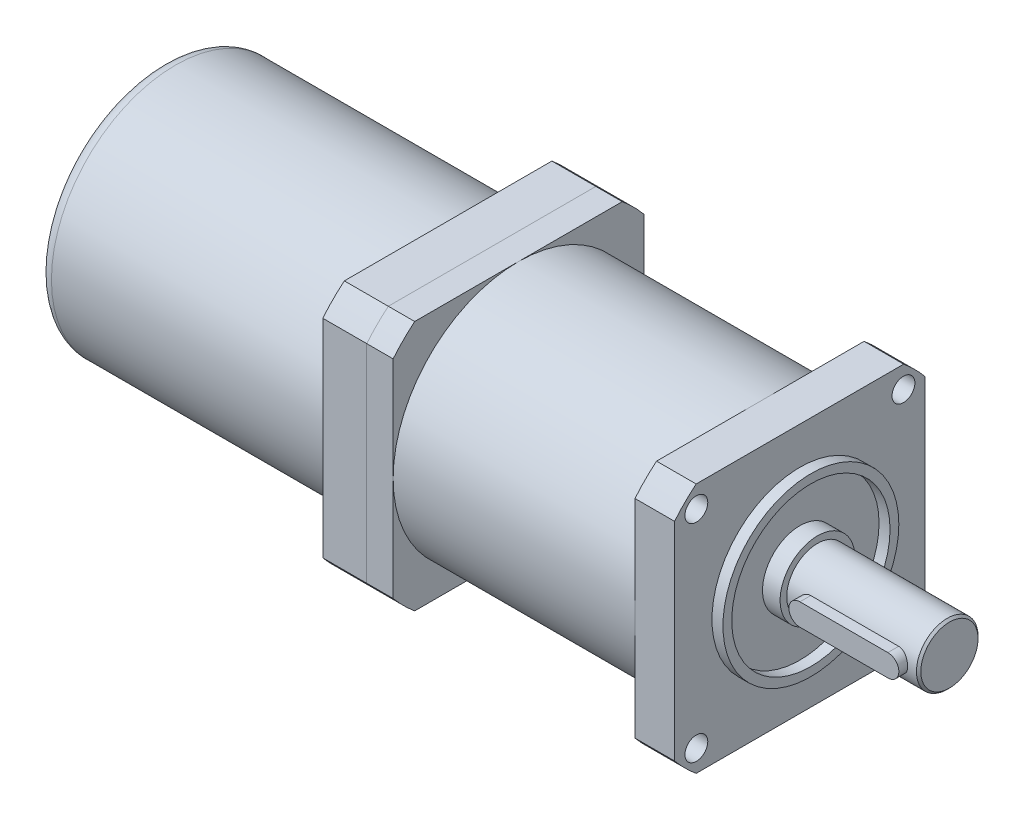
from build123d import *

# Parameters (mm, degrees)
EXTRUDE_1_DEPTH     = 9
SKETCH_2_R          = 28.5
EXTRUDE_2_DEPTH     = 55
EXTRUDE_3_DEPTH     = 6
SKETCH_6_R          = 2.6
CUT_EXTRUDE_2_DEPTH = 9
SKETCH_7_R          = 20
SKETCH_7_R_2        = 18
EXTRUDE_5_DEPTH     = 2.5
SKETCH_8_R          = 8.5
EXTRUDE_6_DEPTH     = 4
SKETCH_9_R          = 7
EXTRUDE_7_DEPTH     = 30
CUT_EXTRUDE_3_DEPTH = 3
EXTRUDE_START       = 5
EXTRUDE_8_DEPTH     = 5
CHAMFER_1_SIZE      = 0.5
EXTRUDE_9_DEPTH     = 10
SKETCH_15_R         = 28.2
EXTRUDE_10_DEPTH    = 65
FILLET_1_R          = 3


with BuildPart() as part:
    # Sketch 1 → Extrude 1 (new body)
    with BuildSketch(Plane(origin=(0, 0, 0), x_dir=(0, 0, -1), z_dir=(1, 0, 0))):
        with BuildLine():
            Line((-23.595550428, -28.5), (23.595550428, -28.5))
            ThreePointArc((23.595550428, -28.5), (26.162950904, -26.162950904), (28.5, -23.595550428))
            Line((28.5, -23.595550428), (28.5, 23.595550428))
            ThreePointArc((28.5, 23.595550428), (26.162950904, 26.162950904), (23.595550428, 28.5))
            Line((23.595550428, 28.5), (-23.595550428, 28.5))
            ThreePointArc((-23.595550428, 28.5), (-26.162950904, 26.162950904), (-28.5, 23.595550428))
            Line((-28.5, 23.595550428), (-28.5, -23.595550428))
            ThreePointArc((-28.5, -23.595550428), (-26.162950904, -26.162950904), (-23.595550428, -28.5))
        make_face()
    extrude(amount=-EXTRUDE_1_DEPTH)

    # Sketch 2 → Extrude 2 (add)
    with BuildSketch(Plane.ZY.offset(9)):
        Circle(SKETCH_2_R)
    extrude(amount=EXTRUDE_2_DEPTH)

    # Sketch 3 → Extrude 3 (add)
    with BuildSketch(Plane.ZY.offset(64)):
        with BuildLine():
            Line((-23.595550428, -28.5), (23.595550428, -28.5))
            ThreePointArc((23.595550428, -28.5), (26.162950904, -26.162950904), (28.5, -23.595550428))
            Line((28.5, -23.595550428), (28.5, 23.595550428))
            ThreePointArc((28.5, 23.595550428), (26.162950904, 26.162950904), (23.595550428, 28.5))
            Line((23.595550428, 28.5), (-23.595550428, 28.5))
            ThreePointArc((-23.595550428, 28.5), (-26.162950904, 26.162950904), (-28.5, 23.595550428))
            Line((-28.5, 23.595550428), (-28.5, -23.595550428))
            ThreePointArc((-28.5, -23.595550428), (-26.162950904, -26.162950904), (-23.595550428, -28.5))
        make_face()
    extrude(amount=EXTRUDE_3_DEPTH)

    # Sketch 6 → Cut-Extrude 2 (cut)
    with BuildSketch(Plane(origin=(0, 0, 0), x_dir=(0, 0, -1), z_dir=(1, 0, 0))):
        with Locations((-23.55, 23.55)):
            Circle(SKETCH_6_R)
        with Locations((23.55, 23.55)):
            Circle(SKETCH_6_R)
        with Locations((23.55, -23.55)):
            Circle(SKETCH_6_R)
        with Locations((-23.55, -23.55)):
            Circle(SKETCH_6_R)
    extrude(amount=-CUT_EXTRUDE_2_DEPTH, mode=Mode.SUBTRACT)

    # Sketch 7 → Extrude 5 (add)
    with BuildSketch(Plane(origin=(0, 0, 0), x_dir=(0, 0, -1), z_dir=(1, 0, 0))):
        Circle(SKETCH_7_R)
        Circle(SKETCH_7_R_2, mode=Mode.SUBTRACT)
    extrude(amount=EXTRUDE_5_DEPTH)

    # Sketch 8 → Extrude 6 (add)
    with BuildSketch(Plane(origin=(0, 0, 0), x_dir=(0, 0, -1), z_dir=(1, 0, 0))):
        Circle(SKETCH_8_R)
    extrude(amount=EXTRUDE_6_DEPTH)

    # Sketch 9 → Extrude 7 (add)
    with BuildSketch(Plane(origin=(4, 0, 0), x_dir=(0, 0, -1), z_dir=(1, 0, 0))):
        Circle(SKETCH_9_R)
    extrude(amount=EXTRUDE_7_DEPTH)

    # Sketch 10 → Cut-Extrude 3 (cut)
    with BuildSketch(Plane.XY.offset(7)):
        with BuildLine():
            Line((9, 2.5), (29, 2.5))
            ThreePointArc((29, 2.5), (31.5, 0), (29, -2.5))
            Line((29, -2.5), (9, -2.5))
            ThreePointArc((9, -2.5), (6.5, 0), (9, 2.5))
        make_face()
    extrude(amount=-CUT_EXTRUDE_3_DEPTH, mode=Mode.SUBTRACT)

    # Sketch 11 → Extrude 8 (add)
    with BuildSketch(Plane.XY.offset(4).offset(EXTRUDE_START)):
        with BuildLine():
            Line((9, 2.5), (29, 2.5))
            ThreePointArc((29, 2.5), (31.5, 0), (29, -2.5))
            Line((29, -2.5), (9, -2.5))
            ThreePointArc((9, -2.5), (6.5, 0), (9, 2.5))
        make_face()
    extrude(amount=-EXTRUDE_8_DEPTH)

    # Chamfer 1
    chamfer_1_edges = [part.edges().sort_by_distance(p)[0] for p in [
        (34, 0, 7),
    ]]
    chamfer(chamfer_1_edges, length=CHAMFER_1_SIZE)


with BuildPart() as body_2:
    # Sketch 14 → Extrude 9 (new body)
    with BuildSketch(Plane.ZY.offset(70)):
        with BuildLine():
            Line((-23.595550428, -28.5), (23.595550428, -28.5))
            ThreePointArc((23.595550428, -28.5), (26.162950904, -26.162950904), (28.5, -23.595550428))
            Line((28.5, -23.595550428), (28.5, 23.595550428))
            ThreePointArc((28.5, 23.595550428), (26.162950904, 26.162950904), (23.595550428, 28.5))
            Line((23.595550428, 28.5), (-23.595550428, 28.5))
            ThreePointArc((-23.595550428, 28.5), (-26.162950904, 26.162950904), (-28.5, 23.595550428))
            Line((-28.5, 23.595550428), (-28.5, -23.595550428))
            ThreePointArc((-28.5, -23.595550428), (-26.162950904, -26.162950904), (-23.595550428, -28.5))
        make_face()
    extrude(amount=EXTRUDE_9_DEPTH)

    # Sketch 15 → Extrude 10 (add)
    with BuildSketch(Plane.ZY.offset(80)):
        Circle(SKETCH_15_R)
    extrude(amount=EXTRUDE_10_DEPTH)

    # Fillet 1
    fillet_1_edges = [body_2.edges().sort_by_distance(p)[0] for p in [
        (-145, 0, -28.2),
    ]]
    fillet(fillet_1_edges, radius=FILLET_1_R)


solid = Compound([part.part, body_2.part])
